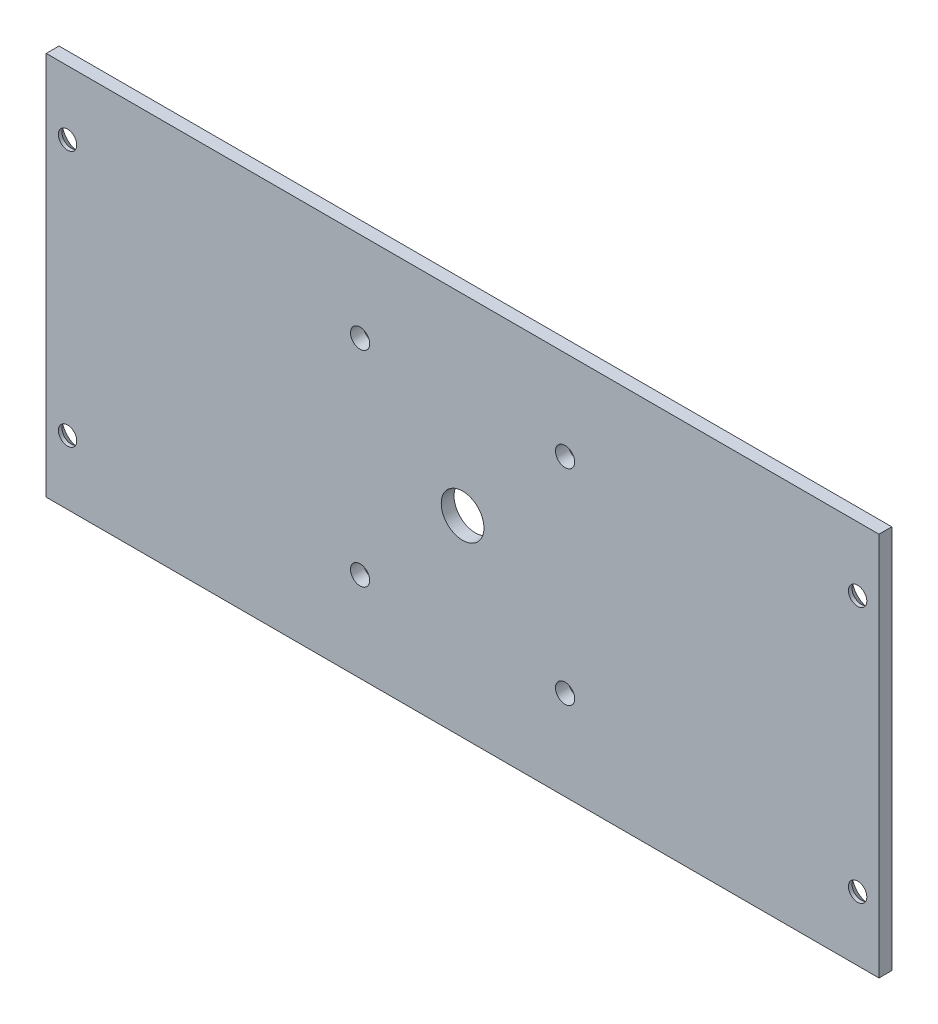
from build123d import *

# Parameters (mm, degrees)
SKETCH_1_W          = 195
SKETCH_1_H          = 90
EXTRUDE_1_DEPTH     = 3
SKETCH_2_R          = 4.3
CUT_EXTRUDE_1_DEPTH = 2.15
DRAFT_1_ANGLE       = 45
SKETCH_3_R          = 2.15
CUT_EXTRUDE_2_DEPTH = 215.778077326
SKETCH_4_R          = 2.15
CUT_EXTRUDE_3_DEPTH = 215.778077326
SKETCH_5_R          = 2.15
CUT_EXTRUDE_4_DEPTH = 215.778077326
SKETCH_6_R          = 2.15
CUT_EXTRUDE_5_DEPTH = 215.778077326
SKETCH_7_R          = 2.25
SKETCH_7_R_2        = 5
CUT_EXTRUDE_6_DEPTH = 215.788267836


with BuildPart() as part:
    # Sketch 1 → Extrude 1 (new body)
    with BuildSketch(Plane.XY):
        with Locations((97.5, 45)):
            Rectangle(SKETCH_1_W, SKETCH_1_H)
    extrude(amount=EXTRUDE_1_DEPTH)

    # Sketch 2 → Cut-Extrude 1 (cut)
    with BuildSketch(Plane(origin=(0, 0, 0), x_dir=(-1, 0, 0), z_dir=(0, 0, -1))):
        with Locations((-190, 75)):
            Circle(SKETCH_2_R)
        with Locations((-190, 15)):
            Circle(SKETCH_2_R)
        with Locations((-5, 75)):
            Circle(SKETCH_2_R)
        with Locations((-5, 15)):
            Circle(SKETCH_2_R)
    extrude(amount=-CUT_EXTRUDE_1_DEPTH, mode=Mode.SUBTRACT)

    # Draft 1
    draft_1_faces = [part.faces().sort_by_distance(p)[0] for p in [
        (9.3, 15, 1.075),
        (9.3, 75, 1.075),
        (194.3, 15, 1.075),
        (194.3, 75, 1.075),
    ]]
    draft(draft_1_faces, Plane(origin=(0, 0, 0), x_dir=(-1, 0, 0), z_dir=(0, 0, -1)), DRAFT_1_ANGLE)

    # Sketch 3 → Cut-Extrude 2 (cut, through all)
    with BuildSketch(Plane(origin=(0, 0, 2.15), x_dir=(-1, 0, 0), z_dir=(0, 0, -1))):
        with Locations((-190, 75)):
            Circle(SKETCH_3_R)
    extrude(amount=-CUT_EXTRUDE_2_DEPTH, mode=Mode.SUBTRACT)

    # Sketch 4 → Cut-Extrude 3 (cut, through all)
    with BuildSketch(Plane(origin=(0, 0, 2.15), x_dir=(-1, 0, 0), z_dir=(0, 0, -1))):
        with Locations((-190, 15)):
            Circle(SKETCH_4_R)
    extrude(amount=-CUT_EXTRUDE_3_DEPTH, mode=Mode.SUBTRACT)

    # Sketch 5 → Cut-Extrude 4 (cut, through all)
    with BuildSketch(Plane(origin=(0, 0, 2.15), x_dir=(-1, 0, 0), z_dir=(0, 0, -1))):
        with Locations((-5, 75)):
            Circle(SKETCH_5_R)
    extrude(amount=-CUT_EXTRUDE_4_DEPTH, mode=Mode.SUBTRACT)

    # Sketch 6 → Cut-Extrude 5 (cut, through all)
    with BuildSketch(Plane(origin=(0, 0, 2.15), x_dir=(-1, 0, 0), z_dir=(0, 0, -1))):
        with Locations((-5, 15)):
            Circle(SKETCH_6_R)
    extrude(amount=-CUT_EXTRUDE_5_DEPTH, mode=Mode.SUBTRACT)

    # Sketch 7 → Cut-Extrude 6 (cut, through all)
    with BuildSketch(Plane(origin=(0, 0, 0), x_dir=(-1, 0, 0), z_dir=(0, 0, -1))):
        with Locations(Location((-121.5, 69, 0), (0, 0, 2.8e-07))):
            Circle(SKETCH_7_R)
        with Locations(Location((-121.5, 21, 0), (0, 0, 2.8e-07))):
            Circle(SKETCH_7_R)
        with Locations(Location((-73.5, 69, 0), (0, 0, 2.8e-07))):
            Circle(SKETCH_7_R)
        with Locations(Location((-73.5, 21, 0), (0, 0, 2.8e-07))):
            Circle(SKETCH_7_R)
        with Locations(Location((-97.5, 45, 0), (0, 0, 1.26e-07))):
            Circle(SKETCH_7_R_2)
    extrude(amount=-CUT_EXTRUDE_6_DEPTH, mode=Mode.SUBTRACT)


solid = part.part
